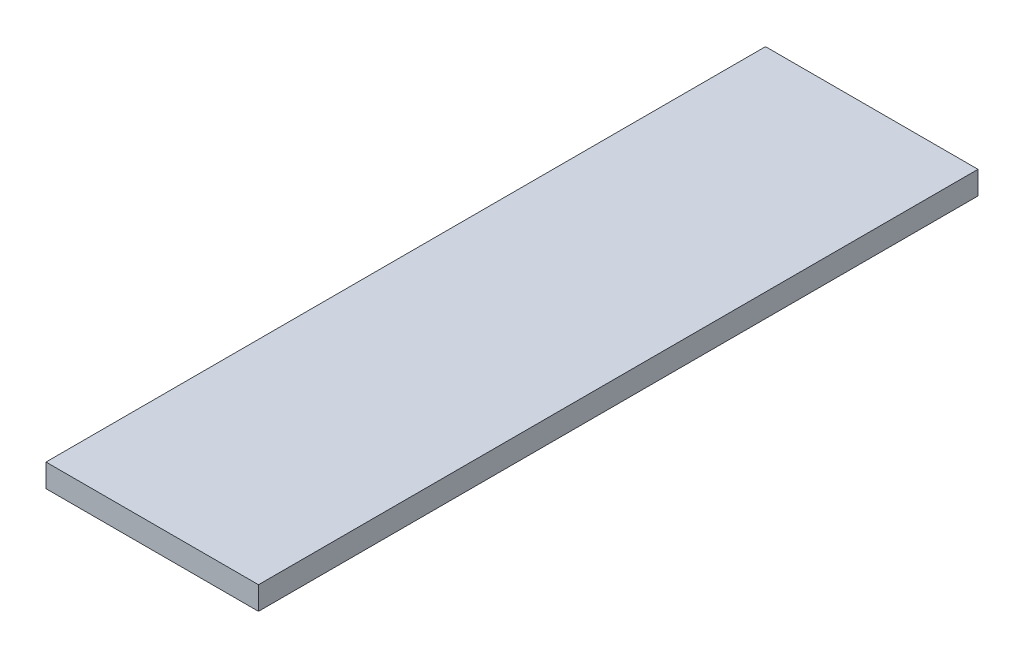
from build123d import *

# Parameters (mm, degrees)
SKETCH1_W           = 1168.4
SKETCH1_H           = 3956.14144
BOSS_EXTRUDE1_DEPTH = 127


with BuildPart() as part:
    # Sketch1 → Boss-Extrude1 (new body)
    with BuildSketch(Plane(origin=(0, 0, 0), x_dir=(1, 0, 0), z_dir=(0, 1, 0))):
        Rectangle(SKETCH1_W, SKETCH1_H)
    extrude(amount=BOSS_EXTRUDE1_DEPTH)


solid = part.part
